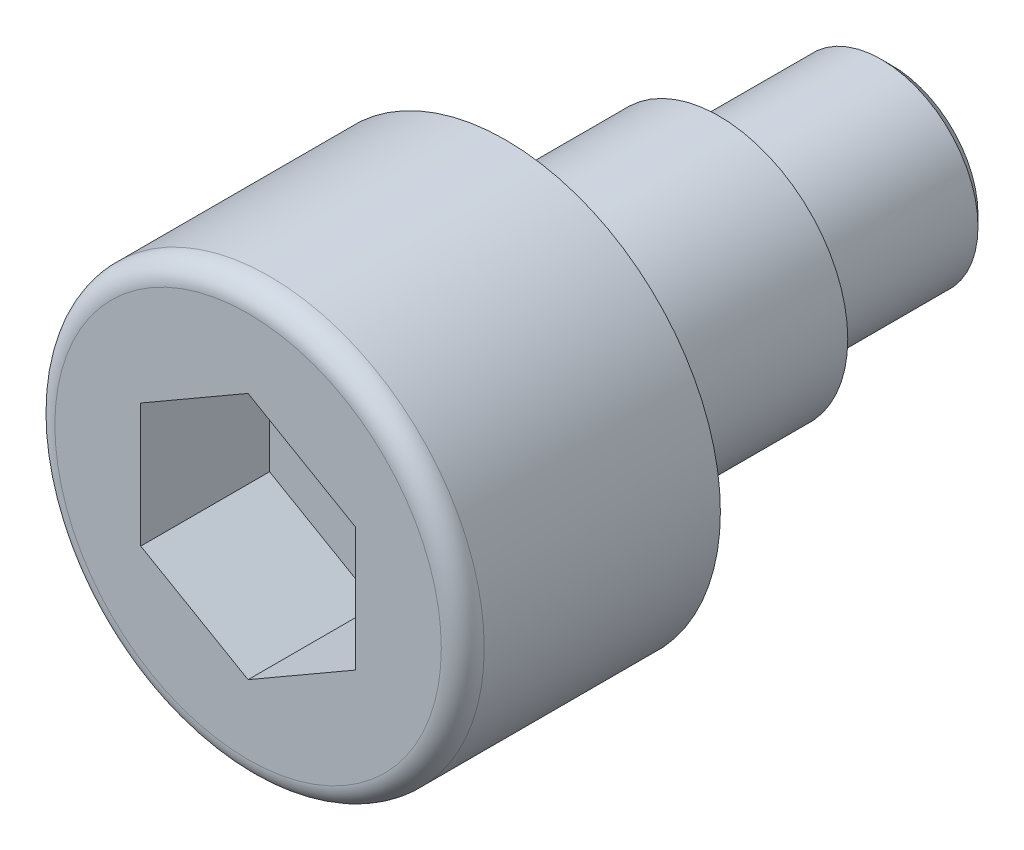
ISO-10303-21;
HEADER;
FILE_DESCRIPTION(('STEP AP214'),'2;1');
FILE_NAME('part.step','',(''),(''),'','','');
FILE_SCHEMA(('AUTOMOTIVE_DESIGN { 1 0 10303 214 1 1 1 1 }'));
ENDSEC;
DATA;
#1=APPLICATION_CONTEXT('core data for automotive mechanical design processes');
#2=APPLICATION_PROTOCOL_DEFINITION('international standard','automotive_design',2000,#1);
#3=PRODUCT_CONTEXT('',#1,'mechanical');
#4=PRODUCT('Part','Part','',(#3));
#5=PRODUCT_RELATED_PRODUCT_CATEGORY('part','',(#4));
#6=PRODUCT_DEFINITION_FORMATION('','',#4);
#7=PRODUCT_DEFINITION_CONTEXT('part definition',#1,'design');
#8=PRODUCT_DEFINITION('design','',#6,#7);
#9=PRODUCT_DEFINITION_SHAPE('','',#8);
#10=(LENGTH_UNIT() NAMED_UNIT(*) SI_UNIT(.MILLI.,.METRE.));
#11=(NAMED_UNIT(*) PLANE_ANGLE_UNIT() SI_UNIT($,.RADIAN.));
#12=(NAMED_UNIT(*) SI_UNIT($,.STERADIAN.) SOLID_ANGLE_UNIT());
#13=UNCERTAINTY_MEASURE_WITH_UNIT(LENGTH_MEASURE(1.E-05),#10,'distance_accuracy_value','');
#14=(GEOMETRIC_REPRESENTATION_CONTEXT(3) GLOBAL_UNCERTAINTY_ASSIGNED_CONTEXT((#13)) GLOBAL_UNIT_ASSIGNED_CONTEXT((#10,
#11,#12)) REPRESENTATION_CONTEXT('',''));
#15=CARTESIAN_POINT('',(0.,0.,0.));
#16=DIRECTION('',(0.,0.,1.));
#17=DIRECTION('',(1.,0.,0.));
#18=AXIS2_PLACEMENT_3D('',#15,#16,#17);
#19=CARTESIAN_POINT('',(0.,2.,-9.));
#20=DIRECTION('',(0.,0.,-1.));
#21=DIRECTION('',(-1.,0.,0.));
#22=AXIS2_PLACEMENT_3D('',#19,#20,#21);
#23=PLANE('',#22);
#24=CARTESIAN_POINT('',(0.,0.,-9.0000000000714));
#25=DIRECTION('',(0.,0.,1.));
#26=DIRECTION('',(1.,0.,0.));
#27=AXIS2_PLACEMENT_3D('',#24,#25,#26);
#28=CIRCLE('',#27,2.00000000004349);
#29=CARTESIAN_POINT('',(2.0000000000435,0.,-9.0000000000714));
#30=VERTEX_POINT('',#29);
#31=EDGE_CURVE('E19',#30,#30,#28,.T.);
#32=ORIENTED_EDGE('',*,*,#31,.F.);
#33=EDGE_LOOP('',(#32));
#34=FACE_BOUND('',#33,.T.);
#35=ADVANCED_FACE('F16',(#34),#23,.T.);
#36=CARTESIAN_POINT('',(0.,0.,-8.75000000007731));
#37=DIRECTION('',(0.,0.,1.));
#38=DIRECTION('',(1.,0.,0.));
#39=AXIS2_PLACEMENT_3D('',#36,#37,#38);
#40=CONICAL_SURFACE('',#39,2.25000000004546,0.785398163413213);
#41=CARTESIAN_POINT('',(0.,0.,-8.75));
#42=DIRECTION('',(0.,0.,-1.));
#43=DIRECTION('',(-1.,0.,0.));
#44=AXIS2_PLACEMENT_3D('',#41,#42,#43);
#45=CIRCLE('',#44,2.25);
#46=CARTESIAN_POINT('',(-2.25,0.,-8.75));
#47=VERTEX_POINT('',#46);
#48=EDGE_CURVE('E97',#47,#47,#45,.F.);
#49=ORIENTED_EDGE('',*,*,#48,.F.);
#50=EDGE_LOOP('',(#49));
#51=FACE_BOUND('',#50,.T.);
#52=ORIENTED_EDGE('',*,*,#31,.T.);
#53=EDGE_LOOP('',(#52));
#54=FACE_BOUND('',#53,.T.);
#55=ADVANCED_FACE('F263',(#51,#54),#40,.T.);
#56=CARTESIAN_POINT('',(0.,0.,0.));
#57=DIRECTION('',(0.,0.,-1.));
#58=DIRECTION('',(-1.,0.,0.));
#59=AXIS2_PLACEMENT_3D('',#56,#57,#58);
#60=CYLINDRICAL_SURFACE('',#59,2.25);
#61=CARTESIAN_POINT('',(0.,0.,-5.39999999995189));
#62=DIRECTION('',(0.,0.,1.));
#63=DIRECTION('',(1.,0.,0.));
#64=AXIS2_PLACEMENT_3D('',#61,#62,#63);
#65=CIRCLE('',#64,2.25000000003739);
#66=CARTESIAN_POINT('',(2.25000000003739,0.,-5.39999999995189));
#67=VERTEX_POINT('',#66);
#68=EDGE_CURVE('E80',#67,#67,#65,.T.);
#69=ORIENTED_EDGE('',*,*,#68,.F.);
#70=EDGE_LOOP('',(#69));
#71=FACE_BOUND('',#70,.T.);
#72=ORIENTED_EDGE('',*,*,#48,.T.);
#73=EDGE_LOOP('',(#72));
#74=FACE_BOUND('',#73,.T.);
#75=ADVANCED_FACE('F256',(#71,#74),#60,.T.);
#76=CARTESIAN_POINT('',(2.5,-4.33012701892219,3.));
#77=DIRECTION('',(0.,0.,-1.));
#78=DIRECTION('',(-1.,0.,0.));
#79=AXIS2_PLACEMENT_3D('',#76,#77,#78);
#80=PLANE('',#79);
#81=DIRECTION('',(0.866025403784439,-0.5,0.));
#82=VECTOR('',#81,1.);
#83=CARTESIAN_POINT('',(2.5,1.44337567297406,3.));
#84=LINE('',#83,#82);
#85=CARTESIAN_POINT('',(0.,2.88675134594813,3.));
#86=VERTEX_POINT('',#85);
#87=CARTESIAN_POINT('',(2.5,1.44337567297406,3.));
#88=VERTEX_POINT('',#87);
#89=EDGE_CURVE('E71',#86,#88,#84,.T.);
#90=ORIENTED_EDGE('',*,*,#89,.F.);
#91=DIRECTION('',(0.866025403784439,0.5,0.));
#92=VECTOR('',#91,1.);
#93=CARTESIAN_POINT('',(0.,2.88675134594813,3.));
#94=LINE('',#93,#92);
#95=CARTESIAN_POINT('',(-2.5,1.44337567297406,3.));
#96=VERTEX_POINT('',#95);
#97=EDGE_CURVE('E288',#96,#86,#94,.T.);
#98=ORIENTED_EDGE('',*,*,#97,.F.);
#99=DIRECTION('',(0.,1.,0.));
#100=VECTOR('',#99,1.);
#101=CARTESIAN_POINT('',(-2.5,1.44337567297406,3.));
#102=LINE('',#101,#100);
#103=CARTESIAN_POINT('',(-2.5,-1.44337567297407,3.));
#104=VERTEX_POINT('',#103);
#105=EDGE_CURVE('E294',#104,#96,#102,.T.);
#106=ORIENTED_EDGE('',*,*,#105,.F.);
#107=DIRECTION('',(-0.866025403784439,0.5,0.));
#108=VECTOR('',#107,1.);
#109=CARTESIAN_POINT('',(-2.5,-1.44337567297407,3.));
#110=LINE('',#109,#108);
#111=CARTESIAN_POINT('',(0.,-2.88675134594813,3.));
#112=VERTEX_POINT('',#111);
#113=EDGE_CURVE('E299',#112,#104,#110,.T.);
#114=ORIENTED_EDGE('',*,*,#113,.F.);
#115=DIRECTION('',(-0.866025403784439,-0.5,0.));
#116=VECTOR('',#115,1.);
#117=CARTESIAN_POINT('',(0.,-2.88675134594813,3.));
#118=LINE('',#117,#116);
#119=CARTESIAN_POINT('',(2.5,-1.44337567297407,3.));
#120=VERTEX_POINT('',#119);
#121=EDGE_CURVE('E84',#120,#112,#118,.T.);
#122=ORIENTED_EDGE('',*,*,#121,.F.);
#123=DIRECTION('',(0.,-1.,0.));
#124=VECTOR('',#123,1.);
#125=CARTESIAN_POINT('',(2.5,-1.44337567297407,3.));
#126=LINE('',#125,#124);
#127=EDGE_CURVE('E66',#88,#120,#126,.T.);
#128=ORIENTED_EDGE('',*,*,#127,.F.);
#129=EDGE_LOOP('',(#90,#98,#106,#114,#122,#128));
#130=FACE_BOUND('',#129,.T.);
#131=ADVANCED_FACE('F82',(#130),#80,.F.);
#132=CARTESIAN_POINT('',(0.,0.,-4.96698729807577));
#133=DIRECTION('',(0.,0.,1.));
#134=DIRECTION('',(1.,0.,0.));
#135=AXIS2_PLACEMENT_3D('',#132,#133,#134);
#136=CONICAL_SURFACE('',#135,3.00000000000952,1.04719755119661);
#137=CARTESIAN_POINT('',(0.,0.,-4.96698729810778));
#138=DIRECTION('',(0.,0.,1.));
#139=DIRECTION('',(1.,0.,0.));
#140=AXIS2_PLACEMENT_3D('',#137,#138,#139);
#141=CIRCLE('',#140,3.);
#142=CARTESIAN_POINT('',(3.,0.,-4.96698729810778));
#143=VERTEX_POINT('',#142);
#144=EDGE_CURVE('E135',#143,#143,#141,.T.);
#145=ORIENTED_EDGE('',*,*,#144,.F.);
#146=EDGE_LOOP('',(#145));
#147=FACE_BOUND('',#146,.T.);
#148=ORIENTED_EDGE('',*,*,#68,.T.);
#149=EDGE_LOOP('',(#148));
#150=FACE_BOUND('',#149,.T.);
#151=ADVANCED_FACE('F242',(#147,#150),#136,.T.);
#152=CARTESIAN_POINT('',(2.5,1.44337567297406,24.3541565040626));
#153=DIRECTION('',(-0.5,-0.866025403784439,0.));
#154=DIRECTION('',(0.866025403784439,-0.5,0.));
#155=AXIS2_PLACEMENT_3D('',#152,#153,#154);
#156=PLANE('',#155);
#157=DIRECTION('',(0.,0.,1.));
#158=VECTOR('',#157,1.);
#159=CARTESIAN_POINT('',(2.5,1.44337567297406,24.3541565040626));
#160=LINE('',#159,#158);
#161=CARTESIAN_POINT('',(2.5,1.44337567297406,6.));
#162=VERTEX_POINT('',#161);
#163=EDGE_CURVE('E73',#162,#88,#160,.F.);
#164=ORIENTED_EDGE('',*,*,#163,.F.);
#165=DIRECTION('',(0.866025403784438,-0.5,0.));
#166=VECTOR('',#165,1.);
#167=CARTESIAN_POINT('',(0.,2.88675134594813,6.));
#168=LINE('',#167,#166);
#169=CARTESIAN_POINT('',(0.,2.88675134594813,6.));
#170=VERTEX_POINT('',#169);
#171=EDGE_CURVE('E134',#170,#162,#168,.T.);
#172=ORIENTED_EDGE('',*,*,#171,.F.);
#173=DIRECTION('',(0.,0.,1.));
#174=VECTOR('',#173,1.);
#175=CARTESIAN_POINT('',(0.,2.88675134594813,24.3541565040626));
#176=LINE('',#175,#174);
#177=EDGE_CURVE('E76',#86,#170,#176,.T.);
#178=ORIENTED_EDGE('',*,*,#177,.F.);
#179=ORIENTED_EDGE('',*,*,#89,.T.);
#180=EDGE_LOOP('',(#164,#172,#178,#179));
#181=FACE_BOUND('',#180,.T.);
#182=ADVANCED_FACE('F72',(#181),#156,.T.);
#183=CARTESIAN_POINT('',(2.5,-1.44337567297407,24.3541565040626));
#184=DIRECTION('',(-1.,0.,0.));
#185=DIRECTION('',(0.,-1.,0.));
#186=AXIS2_PLACEMENT_3D('',#183,#184,#185);
#187=PLANE('',#186);
#188=DIRECTION('',(0.,0.,1.));
#189=VECTOR('',#188,1.);
#190=CARTESIAN_POINT('',(2.5,-1.44337567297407,24.3541565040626));
#191=LINE('',#190,#189);
#192=CARTESIAN_POINT('',(2.5,-1.44337567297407,6.));
#193=VERTEX_POINT('',#192);
#194=EDGE_CURVE('E86',#193,#120,#191,.F.);
#195=ORIENTED_EDGE('',*,*,#194,.F.);
#196=DIRECTION('',(0.,1.,0.));
#197=VECTOR('',#196,1.);
#198=CARTESIAN_POINT('',(2.5,0.,6.));
#199=LINE('',#198,#197);
#200=EDGE_CURVE('E90',#162,#193,#199,.F.);
#201=ORIENTED_EDGE('',*,*,#200,.F.);
#202=ORIENTED_EDGE('',*,*,#163,.T.);
#203=ORIENTED_EDGE('',*,*,#127,.T.);
#204=EDGE_LOOP('',(#195,#201,#202,#203));
#205=FACE_BOUND('',#204,.T.);
#206=ADVANCED_FACE('F88',(#205),#187,.T.);
#207=CARTESIAN_POINT('',(0.,-2.88675134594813,24.3541565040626));
#208=DIRECTION('',(-0.5,0.866025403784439,0.));
#209=DIRECTION('',(-0.866025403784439,-0.5,0.));
#210=AXIS2_PLACEMENT_3D('',#207,#208,#209);
#211=PLANE('',#210);
#212=DIRECTION('',(0.,0.,1.));
#213=VECTOR('',#212,1.);
#214=CARTESIAN_POINT('',(0.,-2.88675134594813,24.3541565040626));
#215=LINE('',#214,#213);
#216=CARTESIAN_POINT('',(0.,-2.88675134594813,6.));
#217=VERTEX_POINT('',#216);
#218=EDGE_CURVE('E301',#217,#112,#215,.F.);
#219=ORIENTED_EDGE('',*,*,#218,.F.);
#220=DIRECTION('',(-0.866025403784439,-0.5,0.));
#221=VECTOR('',#220,1.);
#222=CARTESIAN_POINT('',(2.5,-1.44337567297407,6.));
#223=LINE('',#222,#221);
#224=EDGE_CURVE('E130',#193,#217,#223,.T.);
#225=ORIENTED_EDGE('',*,*,#224,.F.);
#226=ORIENTED_EDGE('',*,*,#194,.T.);
#227=ORIENTED_EDGE('',*,*,#121,.T.);
#228=EDGE_LOOP('',(#219,#225,#226,#227));
#229=FACE_BOUND('',#228,.T.);
#230=ADVANCED_FACE('F221',(#229),#211,.T.);
#231=CARTESIAN_POINT('',(-2.5,-1.44337567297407,24.3541565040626));
#232=DIRECTION('',(0.5,0.866025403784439,0.));
#233=DIRECTION('',(-0.866025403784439,0.5,0.));
#234=AXIS2_PLACEMENT_3D('',#231,#232,#233);
#235=PLANE('',#234);
#236=DIRECTION('',(0.,0.,-1.));
#237=VECTOR('',#236,1.);
#238=CARTESIAN_POINT('',(-2.5,-1.44337567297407,24.3541565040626));
#239=LINE('',#238,#237);
#240=CARTESIAN_POINT('',(-2.5,-1.44337567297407,6.));
#241=VERTEX_POINT('',#240);
#242=EDGE_CURVE('E296',#241,#104,#239,.T.);
#243=ORIENTED_EDGE('',*,*,#242,.F.);
#244=DIRECTION('',(-0.866025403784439,0.5,0.));
#245=VECTOR('',#244,1.);
#246=CARTESIAN_POINT('',(0.,-2.88675134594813,6.));
#247=LINE('',#246,#245);
#248=EDGE_CURVE('E120',#217,#241,#247,.T.);
#249=ORIENTED_EDGE('',*,*,#248,.F.);
#250=ORIENTED_EDGE('',*,*,#218,.T.);
#251=ORIENTED_EDGE('',*,*,#113,.T.);
#252=EDGE_LOOP('',(#243,#249,#250,#251));
#253=FACE_BOUND('',#252,.T.);
#254=ADVANCED_FACE('F214',(#253),#235,.T.);
#255=CARTESIAN_POINT('',(-2.5,1.44337567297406,24.3541565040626));
#256=DIRECTION('',(1.,0.,0.));
#257=DIRECTION('',(0.,0.,-1.));
#258=AXIS2_PLACEMENT_3D('',#255,#256,#257);
#259=PLANE('',#258);
#260=DIRECTION('',(0.,0.,1.));
#261=VECTOR('',#260,1.);
#262=CARTESIAN_POINT('',(-2.5,1.44337567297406,24.3541565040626));
#263=LINE('',#262,#261);
#264=CARTESIAN_POINT('',(-2.5,1.44337567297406,6.));
#265=VERTEX_POINT('',#264);
#266=EDGE_CURVE('E34',#265,#96,#263,.F.);
#267=ORIENTED_EDGE('',*,*,#266,.F.);
#268=DIRECTION('',(0.,1.,0.));
#269=VECTOR('',#268,1.);
#270=CARTESIAN_POINT('',(-2.5,0.,6.));
#271=LINE('',#270,#269);
#272=EDGE_CURVE('E116',#241,#265,#271,.T.);
#273=ORIENTED_EDGE('',*,*,#272,.F.);
#274=ORIENTED_EDGE('',*,*,#242,.T.);
#275=ORIENTED_EDGE('',*,*,#105,.T.);
#276=EDGE_LOOP('',(#267,#273,#274,#275));
#277=FACE_BOUND('',#276,.T.);
#278=ADVANCED_FACE('F171',(#277),#259,.T.);
#279=CARTESIAN_POINT('',(0.,2.88675134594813,24.3541565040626));
#280=DIRECTION('',(0.5,-0.866025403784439,0.));
#281=DIRECTION('',(0.866025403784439,0.5,0.));
#282=AXIS2_PLACEMENT_3D('',#279,#280,#281);
#283=PLANE('',#282);
#284=ORIENTED_EDGE('',*,*,#177,.T.);
#285=DIRECTION('',(0.866025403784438,0.5,0.));
#286=VECTOR('',#285,1.);
#287=CARTESIAN_POINT('',(-2.5,1.44337567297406,6.));
#288=LINE('',#287,#286);
#289=EDGE_CURVE('E111',#265,#170,#288,.T.);
#290=ORIENTED_EDGE('',*,*,#289,.F.);
#291=ORIENTED_EDGE('',*,*,#266,.T.);
#292=ORIENTED_EDGE('',*,*,#97,.T.);
#293=EDGE_LOOP('',(#284,#290,#291,#292));
#294=FACE_BOUND('',#293,.T.);
#295=ADVANCED_FACE('F163',(#294),#283,.T.);
#296=CARTESIAN_POINT('',(0.,0.,6.));
#297=DIRECTION('',(0.,0.,1.));
#298=DIRECTION('',(1.,0.,0.));
#299=AXIS2_PLACEMENT_3D('',#296,#297,#298);
#300=PLANE('',#299);
#301=ORIENTED_EDGE('',*,*,#272,.T.);
#302=ORIENTED_EDGE('',*,*,#289,.T.);
#303=ORIENTED_EDGE('',*,*,#171,.T.);
#304=ORIENTED_EDGE('',*,*,#200,.T.);
#305=ORIENTED_EDGE('',*,*,#224,.T.);
#306=ORIENTED_EDGE('',*,*,#248,.T.);
#307=EDGE_LOOP('',(#301,#302,#303,#304,#305,#306));
#308=FACE_BOUND('',#307,.T.);
#309=CARTESIAN_POINT('',(0.,0.,6.));
#310=DIRECTION('',(0.,0.,-1.));
#311=DIRECTION('',(1.,0.,0.));
#312=AXIS2_PLACEMENT_3D('',#309,#310,#311);
#313=CIRCLE('',#312,4.5);
#314=CARTESIAN_POINT('',(4.5,0.,6.));
#315=VERTEX_POINT('',#314);
#316=EDGE_CURVE('E105',#315,#315,#313,.T.);
#317=ORIENTED_EDGE('',*,*,#316,.F.);
#318=EDGE_LOOP('',(#317));
#319=FACE_BOUND('',#318,.T.);
#320=ADVANCED_FACE('F161',(#308,#319),#300,.T.);
#321=CARTESIAN_POINT('',(0.,0.,11.3541565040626));
#322=DIRECTION('',(0.,0.,1.));
#323=DIRECTION('',(1.,0.,0.));
#324=AXIS2_PLACEMENT_3D('',#321,#322,#323);
#325=CYLINDRICAL_SURFACE('',#324,3.);
#326=CARTESIAN_POINT('',(0.,0.,0.));
#327=DIRECTION('',(0.,0.,1.));
#328=DIRECTION('',(1.,0.,0.));
#329=AXIS2_PLACEMENT_3D('',#326,#327,#328);
#330=CIRCLE('',#329,3.);
#331=CARTESIAN_POINT('',(3.,0.,0.));
#332=VERTEX_POINT('',#331);
#333=EDGE_CURVE('E103',#332,#332,#330,.T.);
#334=ORIENTED_EDGE('',*,*,#333,.F.);
#335=EDGE_LOOP('',(#334));
#336=FACE_BOUND('',#335,.T.);
#337=ORIENTED_EDGE('',*,*,#144,.T.);
#338=EDGE_LOOP('',(#337));
#339=FACE_BOUND('',#338,.T.);
#340=ADVANCED_FACE('F154',(#336,#339),#325,.T.);
#341=CARTESIAN_POINT('',(0.,0.,5.5));
#342=DIRECTION('',(0.,0.,1.));
#343=DIRECTION('',(1.,0.,0.));
#344=AXIS2_PLACEMENT_3D('',#341,#342,#343);
#345=TOROIDAL_SURFACE('',#344,4.5,0.5);
#346=CARTESIAN_POINT('',(0.,0.,5.5));
#347=DIRECTION('',(0.,0.,-1.));
#348=DIRECTION('',(-1.,0.,0.));
#349=AXIS2_PLACEMENT_3D('',#346,#347,#348);
#350=CIRCLE('',#349,5.);
#351=CARTESIAN_POINT('',(-5.,0.,5.5));
#352=VERTEX_POINT('',#351);
#353=EDGE_CURVE('E25',#352,#352,#350,.T.);
#354=ORIENTED_EDGE('',*,*,#353,.F.);
#355=EDGE_LOOP('',(#354));
#356=FACE_BOUND('',#355,.T.);
#357=ORIENTED_EDGE('',*,*,#316,.T.);
#358=EDGE_LOOP('',(#357));
#359=FACE_BOUND('',#358,.T.);
#360=ADVANCED_FACE('F142',(#356,#359),#345,.T.);
#361=CARTESIAN_POINT('',(0.,0.,0.));
#362=DIRECTION('',(0.,0.,-1.));
#363=DIRECTION('',(-1.,0.,0.));
#364=AXIS2_PLACEMENT_3D('',#361,#362,#363);
#365=PLANE('',#364);
#366=ORIENTED_EDGE('',*,*,#333,.T.);
#367=EDGE_LOOP('',(#366));
#368=FACE_BOUND('',#367,.T.);
#369=CARTESIAN_POINT('',(0.,0.,0.));
#370=DIRECTION('',(0.,0.,-1.));
#371=DIRECTION('',(-1.,0.,0.));
#372=AXIS2_PLACEMENT_3D('',#369,#370,#371);
#373=CIRCLE('',#372,5.);
#374=CARTESIAN_POINT('',(-5.,0.,0.));
#375=VERTEX_POINT('',#374);
#376=EDGE_CURVE('E11',#375,#375,#373,.F.);
#377=ORIENTED_EDGE('',*,*,#376,.F.);
#378=EDGE_LOOP('',(#377));
#379=FACE_BOUND('',#378,.T.);
#380=ADVANCED_FACE('F153',(#368,#379),#365,.T.);
#381=CARTESIAN_POINT('',(0.,0.,0.));
#382=DIRECTION('',(0.,0.,-1.));
#383=DIRECTION('',(-1.,0.,0.));
#384=AXIS2_PLACEMENT_3D('',#381,#382,#383);
#385=CYLINDRICAL_SURFACE('',#384,5.);
#386=ORIENTED_EDGE('',*,*,#376,.T.);
#387=EDGE_LOOP('',(#386));
#388=FACE_BOUND('',#387,.T.);
#389=ORIENTED_EDGE('',*,*,#353,.T.);
#390=EDGE_LOOP('',(#389));
#391=FACE_BOUND('',#390,.T.);
#392=ADVANCED_FACE('F175',(#388,#391),#385,.T.);
#393=CLOSED_SHELL('',(#35,#55,#75,#131,#151,#182,#206,#230,#254,#278,#295,#320,#340,#360,#380,#392));
#394=MANIFOLD_SOLID_BREP('B1',#393);
#395=ADVANCED_BREP_SHAPE_REPRESENTATION('',(#18,#394),#14);
#396=SHAPE_DEFINITION_REPRESENTATION(#9,#395);
ENDSEC;
END-ISO-10303-21;
